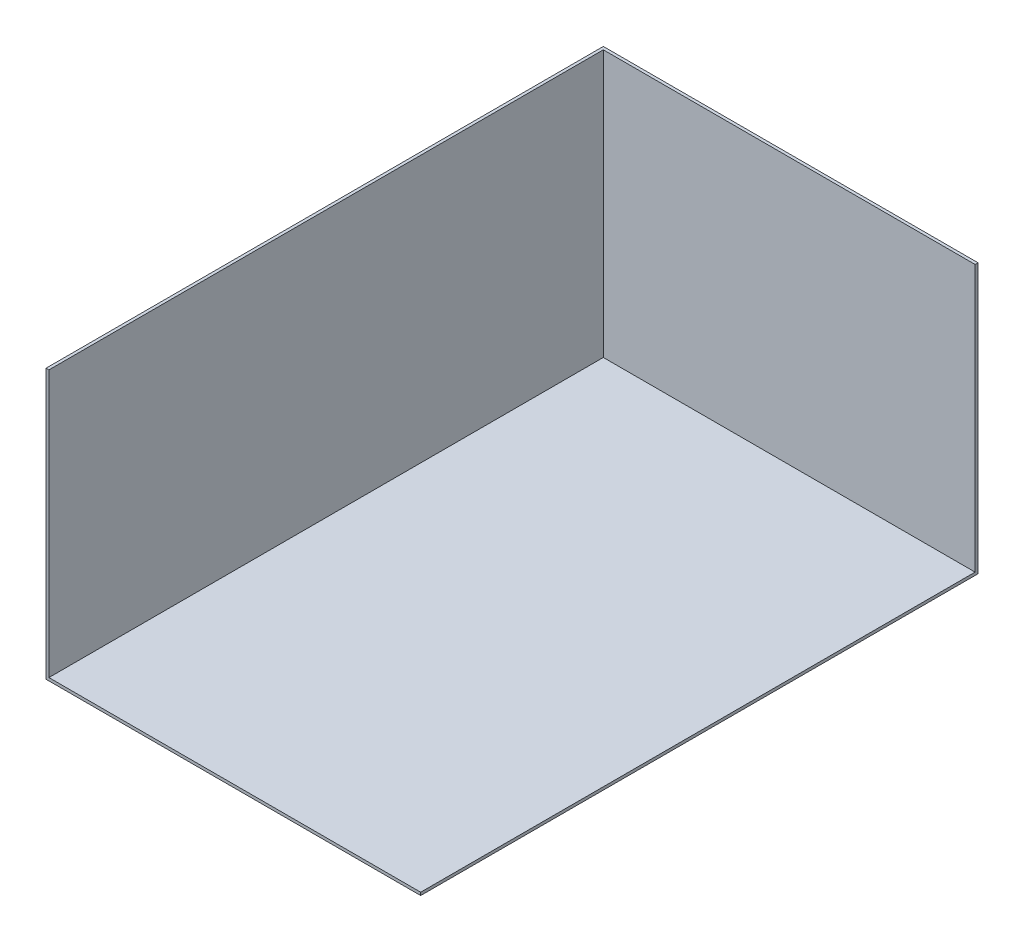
ISO-10303-21;
HEADER;
FILE_DESCRIPTION(('STEP AP214'),'2;1');
FILE_NAME('part.step','',(''),(''),'','','');
FILE_SCHEMA(('AUTOMOTIVE_DESIGN { 1 0 10303 214 1 1 1 1 }'));
ENDSEC;
DATA;
#1=APPLICATION_CONTEXT('core data for automotive mechanical design processes');
#2=APPLICATION_PROTOCOL_DEFINITION('international standard','automotive_design',2000,#1);
#3=PRODUCT_CONTEXT('',#1,'mechanical');
#4=PRODUCT('Part','Part','',(#3));
#5=PRODUCT_RELATED_PRODUCT_CATEGORY('part','',(#4));
#6=PRODUCT_DEFINITION_FORMATION('','',#4);
#7=PRODUCT_DEFINITION_CONTEXT('part definition',#1,'design');
#8=PRODUCT_DEFINITION('design','',#6,#7);
#9=PRODUCT_DEFINITION_SHAPE('','',#8);
#10=(LENGTH_UNIT() NAMED_UNIT(*) SI_UNIT(.MILLI.,.METRE.));
#11=(NAMED_UNIT(*) PLANE_ANGLE_UNIT() SI_UNIT($,.RADIAN.));
#12=(NAMED_UNIT(*) SI_UNIT($,.STERADIAN.) SOLID_ANGLE_UNIT());
#13=UNCERTAINTY_MEASURE_WITH_UNIT(LENGTH_MEASURE(1.E-05),#10,'distance_accuracy_value','');
#14=(GEOMETRIC_REPRESENTATION_CONTEXT(3) GLOBAL_UNCERTAINTY_ASSIGNED_CONTEXT((#13)) GLOBAL_UNIT_ASSIGNED_CONTEXT((#10,
#11,#12)) REPRESENTATION_CONTEXT('',''));
#15=CARTESIAN_POINT('',(0.,0.,0.));
#16=DIRECTION('',(0.,0.,1.));
#17=DIRECTION('',(1.,0.,0.));
#18=AXIS2_PLACEMENT_3D('',#15,#16,#17);
#19=CARTESIAN_POINT('',(128.877391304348,0.,191.7));
#20=DIRECTION('',(-1.,0.,0.));
#21=DIRECTION('',(0.,0.,1.));
#22=AXIS2_PLACEMENT_3D('',#19,#20,#21);
#23=PLANE('',#22);
#24=DIRECTION('',(0.,1.,0.));
#25=VECTOR('',#24,1.);
#26=CARTESIAN_POINT('',(128.877391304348,92.6547826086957,1.));
#27=LINE('',#26,#25);
#28=CARTESIAN_POINT('',(128.877391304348,1.,1.));
#29=VERTEX_POINT('',#28);
#30=CARTESIAN_POINT('',(128.877391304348,92.6547826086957,1.));
#31=VERTEX_POINT('',#30);
#32=EDGE_CURVE('E96',#29,#31,#27,.T.);
#33=ORIENTED_EDGE('',*,*,#32,.F.);
#34=DIRECTION('',(0.,0.,-1.));
#35=VECTOR('',#34,1.);
#36=CARTESIAN_POINT('',(128.877391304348,1.,191.7));
#37=LINE('',#36,#35);
#38=CARTESIAN_POINT('',(128.877391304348,1.,191.7));
#39=VERTEX_POINT('',#38);
#40=EDGE_CURVE('E92',#39,#29,#37,.T.);
#41=ORIENTED_EDGE('',*,*,#40,.F.);
#42=DIRECTION('',(0.,1.,0.));
#43=VECTOR('',#42,1.);
#44=CARTESIAN_POINT('',(128.877391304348,0.,191.7));
#45=LINE('',#44,#43);
#46=CARTESIAN_POINT('',(128.877391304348,0.,191.7));
#47=VERTEX_POINT('',#46);
#48=EDGE_CURVE('E133',#47,#39,#45,.T.);
#49=ORIENTED_EDGE('',*,*,#48,.F.);
#50=DIRECTION('',(0.,0.,-1.));
#51=VECTOR('',#50,1.);
#52=CARTESIAN_POINT('',(128.877391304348,0.,191.7));
#53=LINE('',#52,#51);
#54=CARTESIAN_POINT('',(128.877391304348,0.,0.));
#55=VERTEX_POINT('',#54);
#56=EDGE_CURVE('E38',#47,#55,#53,.T.);
#57=ORIENTED_EDGE('',*,*,#56,.T.);
#58=DIRECTION('',(0.,1.,0.));
#59=VECTOR('',#58,1.);
#60=CARTESIAN_POINT('',(128.877391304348,0.,0.));
#61=LINE('',#60,#59);
#62=CARTESIAN_POINT('',(128.877391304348,92.6547826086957,0.));
#63=VERTEX_POINT('',#62);
#64=EDGE_CURVE('E124',#55,#63,#61,.T.);
#65=ORIENTED_EDGE('',*,*,#64,.T.);
#66=DIRECTION('',(0.,0.,-1.));
#67=VECTOR('',#66,1.);
#68=CARTESIAN_POINT('',(128.877391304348,92.6547826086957,191.7));
#69=LINE('',#68,#67);
#70=EDGE_CURVE('E140',#31,#63,#69,.T.);
#71=ORIENTED_EDGE('',*,*,#70,.F.);
#72=EDGE_LOOP('',(#33,#41,#49,#57,#65,#71));
#73=FACE_BOUND('',#72,.T.);
#74=ADVANCED_FACE('F30',(#73),#23,.F.);
#75=CARTESIAN_POINT('',(0.,92.6547826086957,191.7));
#76=DIRECTION('',(0.,-1.,0.));
#77=DIRECTION('',(0.,0.,-1.));
#78=AXIS2_PLACEMENT_3D('',#75,#76,#77);
#79=PLANE('',#78);
#80=DIRECTION('',(-1.,0.,0.));
#81=VECTOR('',#80,1.);
#82=CARTESIAN_POINT('',(0.,92.6547826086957,1.));
#83=LINE('',#82,#81);
#84=CARTESIAN_POINT('',(1.,92.6547826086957,1.));
#85=VERTEX_POINT('',#84);
#86=EDGE_CURVE('E109',#31,#85,#83,.T.);
#87=ORIENTED_EDGE('',*,*,#86,.F.);
#88=ORIENTED_EDGE('',*,*,#70,.T.);
#89=DIRECTION('',(-1.,0.,0.));
#90=VECTOR('',#89,1.);
#91=CARTESIAN_POINT('',(0.,92.6547826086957,0.));
#92=LINE('',#91,#90);
#93=CARTESIAN_POINT('',(0.,92.6547826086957,0.));
#94=VERTEX_POINT('',#93);
#95=EDGE_CURVE('E127',#63,#94,#92,.T.);
#96=ORIENTED_EDGE('',*,*,#95,.T.);
#97=DIRECTION('',(0.,0.,-1.));
#98=VECTOR('',#97,1.);
#99=CARTESIAN_POINT('',(0.,92.6547826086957,191.7));
#100=LINE('',#99,#98);
#101=CARTESIAN_POINT('',(0.,92.6547826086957,191.7));
#102=VERTEX_POINT('',#101);
#103=EDGE_CURVE('E137',#102,#94,#100,.T.);
#104=ORIENTED_EDGE('',*,*,#103,.F.);
#105=DIRECTION('',(-1.,0.,0.));
#106=VECTOR('',#105,1.);
#107=CARTESIAN_POINT('',(0.,92.6547826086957,191.7));
#108=LINE('',#107,#106);
#109=CARTESIAN_POINT('',(1.,92.6547826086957,191.7));
#110=VERTEX_POINT('',#109);
#111=EDGE_CURVE('E53',#110,#102,#108,.T.);
#112=ORIENTED_EDGE('',*,*,#111,.F.);
#113=DIRECTION('',(0.,0.,-1.));
#114=VECTOR('',#113,1.);
#115=CARTESIAN_POINT('',(1.,92.6547826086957,191.7));
#116=LINE('',#115,#114);
#117=EDGE_CURVE('E115',#110,#85,#116,.T.);
#118=ORIENTED_EDGE('',*,*,#117,.T.);
#119=EDGE_LOOP('',(#87,#88,#96,#104,#112,#118));
#120=FACE_BOUND('',#119,.T.);
#121=ADVANCED_FACE('F153',(#120),#79,.F.);
#122=CARTESIAN_POINT('',(0.,92.6547826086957,191.7));
#123=DIRECTION('',(0.,0.,-1.));
#124=DIRECTION('',(-1.,0.,0.));
#125=AXIS2_PLACEMENT_3D('',#122,#123,#124);
#126=PLANE('',#125);
#127=DIRECTION('',(0.,-1.,0.));
#128=VECTOR('',#127,1.);
#129=CARTESIAN_POINT('',(1.,92.6547826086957,191.7));
#130=LINE('',#129,#128);
#131=CARTESIAN_POINT('',(1.,1.,191.7));
#132=VERTEX_POINT('',#131);
#133=EDGE_CURVE('E103',#110,#132,#130,.T.);
#134=ORIENTED_EDGE('',*,*,#133,.F.);
#135=ORIENTED_EDGE('',*,*,#111,.T.);
#136=DIRECTION('',(0.,-1.,0.));
#137=VECTOR('',#136,1.);
#138=CARTESIAN_POINT('',(0.,0.,191.7));
#139=LINE('',#138,#137);
#140=CARTESIAN_POINT('',(0.,0.,191.7));
#141=VERTEX_POINT('',#140);
#142=EDGE_CURVE('E129',#102,#141,#139,.T.);
#143=ORIENTED_EDGE('',*,*,#142,.T.);
#144=DIRECTION('',(1.,0.,0.));
#145=VECTOR('',#144,1.);
#146=CARTESIAN_POINT('',(0.,0.,191.7));
#147=LINE('',#146,#145);
#148=EDGE_CURVE('E131',#141,#47,#147,.T.);
#149=ORIENTED_EDGE('',*,*,#148,.T.);
#150=ORIENTED_EDGE('',*,*,#48,.T.);
#151=DIRECTION('',(1.,0.,0.));
#152=VECTOR('',#151,1.);
#153=CARTESIAN_POINT('',(0.,1.,191.7));
#154=LINE('',#153,#152);
#155=EDGE_CURVE('E113',#132,#39,#154,.T.);
#156=ORIENTED_EDGE('',*,*,#155,.F.);
#157=EDGE_LOOP('',(#134,#135,#143,#149,#150,#156));
#158=FACE_BOUND('',#157,.T.);
#159=ADVANCED_FACE('F157',(#158),#126,.F.);
#160=CARTESIAN_POINT('',(0.,0.,191.7));
#161=DIRECTION('',(1.,0.,0.));
#162=DIRECTION('',(0.,0.,-1.));
#163=AXIS2_PLACEMENT_3D('',#160,#161,#162);
#164=PLANE('',#163);
#165=DIRECTION('',(0.,-1.,0.));
#166=VECTOR('',#165,1.);
#167=CARTESIAN_POINT('',(0.,0.,0.));
#168=LINE('',#167,#166);
#169=CARTESIAN_POINT('',(0.,0.,0.));
#170=VERTEX_POINT('',#169);
#171=EDGE_CURVE('E105',#94,#170,#168,.T.);
#172=ORIENTED_EDGE('',*,*,#171,.T.);
#173=DIRECTION('',(0.,0.,-1.));
#174=VECTOR('',#173,1.);
#175=CARTESIAN_POINT('',(0.,0.,191.7));
#176=LINE('',#175,#174);
#177=EDGE_CURVE('E11',#141,#170,#176,.T.);
#178=ORIENTED_EDGE('',*,*,#177,.F.);
#179=ORIENTED_EDGE('',*,*,#142,.F.);
#180=ORIENTED_EDGE('',*,*,#103,.T.);
#181=EDGE_LOOP('',(#172,#178,#179,#180));
#182=FACE_BOUND('',#181,.T.);
#183=ADVANCED_FACE('F32',(#182),#164,.F.);
#184=CARTESIAN_POINT('',(0.,0.,191.7));
#185=DIRECTION('',(0.,1.,0.));
#186=DIRECTION('',(0.,0.,1.));
#187=AXIS2_PLACEMENT_3D('',#184,#185,#186);
#188=PLANE('',#187);
#189=DIRECTION('',(1.,0.,0.));
#190=VECTOR('',#189,1.);
#191=CARTESIAN_POINT('',(0.,0.,0.));
#192=LINE('',#191,#190);
#193=EDGE_CURVE('E122',#170,#55,#192,.T.);
#194=ORIENTED_EDGE('',*,*,#193,.T.);
#195=ORIENTED_EDGE('',*,*,#56,.F.);
#196=ORIENTED_EDGE('',*,*,#148,.F.);
#197=ORIENTED_EDGE('',*,*,#177,.T.);
#198=EDGE_LOOP('',(#194,#195,#196,#197));
#199=FACE_BOUND('',#198,.T.);
#200=ADVANCED_FACE('F158',(#199),#188,.F.);
#201=CARTESIAN_POINT('',(0.,92.6547826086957,0.));
#202=DIRECTION('',(0.,0.,-1.));
#203=DIRECTION('',(-1.,0.,0.));
#204=AXIS2_PLACEMENT_3D('',#201,#202,#203);
#205=PLANE('',#204);
#206=ORIENTED_EDGE('',*,*,#171,.F.);
#207=ORIENTED_EDGE('',*,*,#95,.F.);
#208=ORIENTED_EDGE('',*,*,#64,.F.);
#209=ORIENTED_EDGE('',*,*,#193,.F.);
#210=EDGE_LOOP('',(#206,#207,#208,#209));
#211=FACE_BOUND('',#210,.T.);
#212=ADVANCED_FACE('F151',(#211),#205,.T.);
#213=CARTESIAN_POINT('',(1.,0.,191.7));
#214=DIRECTION('',(1.,0.,0.));
#215=DIRECTION('',(0.,0.,-1.));
#216=AXIS2_PLACEMENT_3D('',#213,#214,#215);
#217=PLANE('',#216);
#218=DIRECTION('',(0.,-1.,0.));
#219=VECTOR('',#218,1.);
#220=CARTESIAN_POINT('',(1.,92.6547826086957,1.));
#221=LINE('',#220,#219);
#222=CARTESIAN_POINT('',(1.,1.,1.));
#223=VERTEX_POINT('',#222);
#224=EDGE_CURVE('E97',#85,#223,#221,.T.);
#225=ORIENTED_EDGE('',*,*,#224,.F.);
#226=ORIENTED_EDGE('',*,*,#117,.F.);
#227=ORIENTED_EDGE('',*,*,#133,.T.);
#228=DIRECTION('',(0.,0.,-1.));
#229=VECTOR('',#228,1.);
#230=CARTESIAN_POINT('',(1.,1.,191.7));
#231=LINE('',#230,#229);
#232=EDGE_CURVE('E45',#132,#223,#231,.T.);
#233=ORIENTED_EDGE('',*,*,#232,.T.);
#234=EDGE_LOOP('',(#225,#226,#227,#233));
#235=FACE_BOUND('',#234,.T.);
#236=ADVANCED_FACE('F101',(#235),#217,.T.);
#237=CARTESIAN_POINT('',(0.,1.,191.7));
#238=DIRECTION('',(0.,1.,0.));
#239=DIRECTION('',(0.,0.,1.));
#240=AXIS2_PLACEMENT_3D('',#237,#238,#239);
#241=PLANE('',#240);
#242=DIRECTION('',(1.,0.,0.));
#243=VECTOR('',#242,1.);
#244=CARTESIAN_POINT('',(0.,1.,1.));
#245=LINE('',#244,#243);
#246=EDGE_CURVE('E89',#223,#29,#245,.T.);
#247=ORIENTED_EDGE('',*,*,#246,.F.);
#248=ORIENTED_EDGE('',*,*,#232,.F.);
#249=ORIENTED_EDGE('',*,*,#155,.T.);
#250=ORIENTED_EDGE('',*,*,#40,.T.);
#251=EDGE_LOOP('',(#247,#248,#249,#250));
#252=FACE_BOUND('',#251,.T.);
#253=ADVANCED_FACE('F90',(#252),#241,.T.);
#254=CARTESIAN_POINT('',(0.,92.6547826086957,1.));
#255=DIRECTION('',(0.,0.,-1.));
#256=DIRECTION('',(-1.,0.,0.));
#257=AXIS2_PLACEMENT_3D('',#254,#255,#256);
#258=PLANE('',#257);
#259=ORIENTED_EDGE('',*,*,#224,.T.);
#260=ORIENTED_EDGE('',*,*,#246,.T.);
#261=ORIENTED_EDGE('',*,*,#32,.T.);
#262=ORIENTED_EDGE('',*,*,#86,.T.);
#263=EDGE_LOOP('',(#259,#260,#261,#262));
#264=FACE_BOUND('',#263,.T.);
#265=ADVANCED_FACE('F107',(#264),#258,.F.);
#266=CLOSED_SHELL('',(#74,#121,#159,#183,#200,#212,#236,#253,#265));
#267=MANIFOLD_SOLID_BREP('B2',#266);
#268=ADVANCED_BREP_SHAPE_REPRESENTATION('',(#18,#267),#14);
#269=SHAPE_DEFINITION_REPRESENTATION(#9,#268);
ENDSEC;
END-ISO-10303-21;
